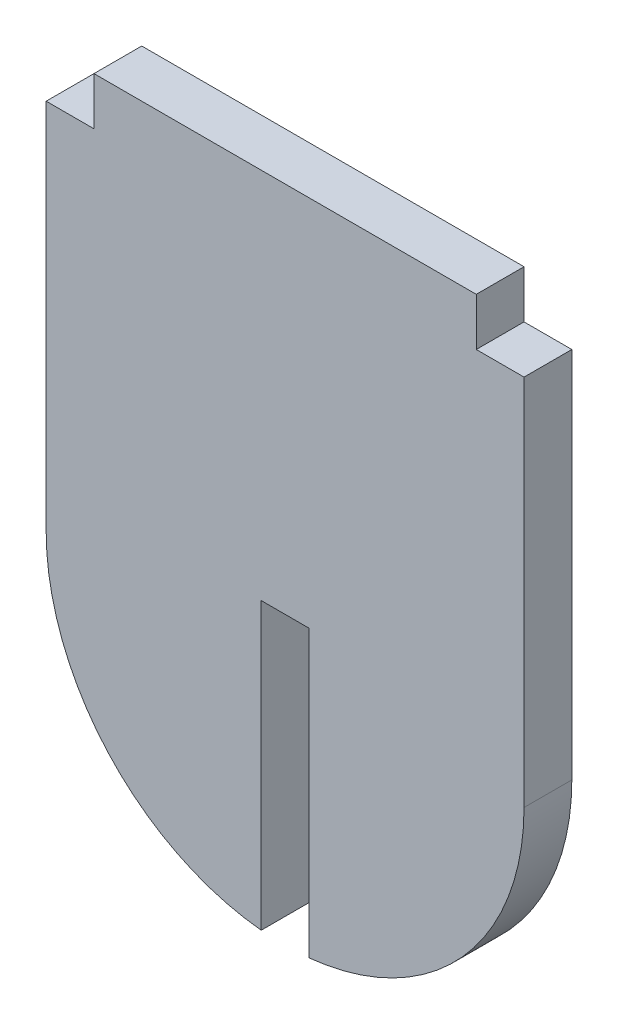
ISO-10303-21;
HEADER;
FILE_DESCRIPTION(('STEP AP214'),'2;1');
FILE_NAME('part.step','',(''),(''),'','','');
FILE_SCHEMA(('AUTOMOTIVE_DESIGN { 1 0 10303 214 1 1 1 1 }'));
ENDSEC;
DATA;
#1=APPLICATION_CONTEXT('core data for automotive mechanical design processes');
#2=APPLICATION_PROTOCOL_DEFINITION('international standard','automotive_design',2000,#1);
#3=PRODUCT_CONTEXT('',#1,'mechanical');
#4=PRODUCT('Part','Part','',(#3));
#5=PRODUCT_RELATED_PRODUCT_CATEGORY('part','',(#4));
#6=PRODUCT_DEFINITION_FORMATION('','',#4);
#7=PRODUCT_DEFINITION_CONTEXT('part definition',#1,'design');
#8=PRODUCT_DEFINITION('design','',#6,#7);
#9=PRODUCT_DEFINITION_SHAPE('','',#8);
#10=(LENGTH_UNIT() NAMED_UNIT(*) SI_UNIT(.MILLI.,.METRE.));
#11=(NAMED_UNIT(*) PLANE_ANGLE_UNIT() SI_UNIT($,.RADIAN.));
#12=(NAMED_UNIT(*) SI_UNIT($,.STERADIAN.) SOLID_ANGLE_UNIT());
#13=UNCERTAINTY_MEASURE_WITH_UNIT(LENGTH_MEASURE(1.E-05),#10,'distance_accuracy_value','');
#14=(GEOMETRIC_REPRESENTATION_CONTEXT(3) GLOBAL_UNCERTAINTY_ASSIGNED_CONTEXT((#13)) GLOBAL_UNIT_ASSIGNED_CONTEXT((#10,
#11,#12)) REPRESENTATION_CONTEXT('',''));
#15=CARTESIAN_POINT('',(0.,0.,0.));
#16=DIRECTION('',(0.,0.,1.));
#17=DIRECTION('',(1.,0.,0.));
#18=AXIS2_PLACEMENT_3D('',#15,#16,#17);
#19=CARTESIAN_POINT('',(0.,-13.97,3.175));
#20=DIRECTION('',(0.,0.,-1.));
#21=DIRECTION('',(-1.,0.,0.));
#22=AXIS2_PLACEMENT_3D('',#19,#20,#21);
#23=CYLINDRICAL_SURFACE('',#22,15.875);
#24=CARTESIAN_POINT('',(0.,-13.97,3.175));
#25=DIRECTION('',(0.,0.,1.));
#26=DIRECTION('',(1.,0.,0.));
#27=AXIS2_PLACEMENT_3D('',#24,#25,#26);
#28=CIRCLE('',#27,15.875);
#29=CARTESIAN_POINT('',(1.58749999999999,-29.7654255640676,3.175));
#30=VERTEX_POINT('',#29);
#31=CARTESIAN_POINT('',(15.875,-13.97,3.175));
#32=VERTEX_POINT('',#31);
#33=EDGE_CURVE('E161',#30,#32,#28,.T.);
#34=ORIENTED_EDGE('',*,*,#33,.F.);
#35=DIRECTION('',(0.,0.,-1.));
#36=VECTOR('',#35,1.);
#37=CARTESIAN_POINT('',(1.58749999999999,-29.7654255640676,3.175));
#38=LINE('',#37,#36);
#39=CARTESIAN_POINT('',(1.58749999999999,-29.7654255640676,0.));
#40=VERTEX_POINT('',#39);
#41=EDGE_CURVE('E171',#30,#40,#38,.T.);
#42=ORIENTED_EDGE('',*,*,#41,.T.);
#43=CARTESIAN_POINT('',(0.,-13.97,0.));
#44=DIRECTION('',(0.,0.,1.));
#45=DIRECTION('',(1.,0.,0.));
#46=AXIS2_PLACEMENT_3D('',#43,#44,#45);
#47=CIRCLE('',#46,15.875);
#48=CARTESIAN_POINT('',(15.875,-13.97,0.));
#49=VERTEX_POINT('',#48);
#50=EDGE_CURVE('E139',#40,#49,#47,.T.);
#51=ORIENTED_EDGE('',*,*,#50,.T.);
#52=DIRECTION('',(0.,0.,-1.));
#53=VECTOR('',#52,1.);
#54=CARTESIAN_POINT('',(15.875,-13.97,3.175));
#55=LINE('',#54,#53);
#56=EDGE_CURVE('E39',#32,#49,#55,.T.);
#57=ORIENTED_EDGE('',*,*,#56,.F.);
#58=EDGE_LOOP('',(#34,#42,#51,#57));
#59=FACE_BOUND('',#58,.T.);
#60=ADVANCED_FACE('F31',(#59),#23,.T.);
#61=CARTESIAN_POINT('',(-15.875,-13.97,0.));
#62=VERTEX_POINT('',#61);
#63=CARTESIAN_POINT('',(-1.58750000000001,-29.7654255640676,0.));
#64=VERTEX_POINT('',#63);
#65=EDGE_CURVE('E145',#62,#64,#47,.T.);
#66=ORIENTED_EDGE('',*,*,#65,.T.);
#67=DIRECTION('',(0.,0.,-1.));
#68=VECTOR('',#67,1.);
#69=CARTESIAN_POINT('',(-1.58750000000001,-29.7654255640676,3.175));
#70=LINE('',#69,#68);
#71=CARTESIAN_POINT('',(-1.58750000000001,-29.7654255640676,3.175));
#72=VERTEX_POINT('',#71);
#73=EDGE_CURVE('E200',#64,#72,#70,.F.);
#74=ORIENTED_EDGE('',*,*,#73,.T.);
#75=CARTESIAN_POINT('',(-15.875,-13.97,3.175));
#76=VERTEX_POINT('',#75);
#77=EDGE_CURVE('E173',#76,#72,#28,.T.);
#78=ORIENTED_EDGE('',*,*,#77,.F.);
#79=DIRECTION('',(0.,0.,-1.));
#80=VECTOR('',#79,1.);
#81=CARTESIAN_POINT('',(-15.875,-13.97,3.175));
#82=LINE('',#81,#80);
#83=EDGE_CURVE('E162',#76,#62,#82,.T.);
#84=ORIENTED_EDGE('',*,*,#83,.T.);
#85=EDGE_LOOP('',(#66,#74,#78,#84));
#86=FACE_BOUND('',#85,.T.);
#87=ADVANCED_FACE('F33',(#86),#23,.T.);
#88=CARTESIAN_POINT('',(15.875,13.97,3.175));
#89=DIRECTION('',(-1.,0.,0.));
#90=DIRECTION('',(0.,0.,1.));
#91=AXIS2_PLACEMENT_3D('',#88,#89,#90);
#92=PLANE('',#91);
#93=DIRECTION('',(0.,1.,0.));
#94=VECTOR('',#93,1.);
#95=CARTESIAN_POINT('',(15.875,13.97,0.));
#96=LINE('',#95,#94);
#97=CARTESIAN_POINT('',(15.875,10.795,0.));
#98=VERTEX_POINT('',#97);
#99=EDGE_CURVE('E141',#49,#98,#96,.T.);
#100=ORIENTED_EDGE('',*,*,#99,.T.);
#101=DIRECTION('',(0.,0.,1.));
#102=VECTOR('',#101,1.);
#103=CARTESIAN_POINT('',(15.875,10.795,0.));
#104=LINE('',#103,#102);
#105=CARTESIAN_POINT('',(15.875,10.795,3.175));
#106=VERTEX_POINT('',#105);
#107=EDGE_CURVE('E215',#98,#106,#104,.T.);
#108=ORIENTED_EDGE('',*,*,#107,.T.);
#109=DIRECTION('',(0.,1.,0.));
#110=VECTOR('',#109,1.);
#111=CARTESIAN_POINT('',(15.875,13.97,3.175));
#112=LINE('',#111,#110);
#113=EDGE_CURVE('E169',#32,#106,#112,.T.);
#114=ORIENTED_EDGE('',*,*,#113,.F.);
#115=ORIENTED_EDGE('',*,*,#56,.T.);
#116=EDGE_LOOP('',(#100,#108,#114,#115));
#117=FACE_BOUND('',#116,.T.);
#118=ADVANCED_FACE('F166',(#117),#92,.F.);
#119=CARTESIAN_POINT('',(-15.875,13.97,3.175));
#120=DIRECTION('',(0.,-1.,0.));
#121=DIRECTION('',(0.,0.,-1.));
#122=AXIS2_PLACEMENT_3D('',#119,#120,#121);
#123=PLANE('',#122);
#124=DIRECTION('',(-1.,0.,0.));
#125=VECTOR('',#124,1.);
#126=CARTESIAN_POINT('',(-15.875,13.97,3.175));
#127=LINE('',#126,#125);
#128=CARTESIAN_POINT('',(12.7,13.97,3.175));
#129=VERTEX_POINT('',#128);
#130=CARTESIAN_POINT('',(-12.7,13.97,3.175));
#131=VERTEX_POINT('',#130);
#132=EDGE_CURVE('E180',#129,#131,#127,.T.);
#133=ORIENTED_EDGE('',*,*,#132,.F.);
#134=DIRECTION('',(0.,0.,1.));
#135=VECTOR('',#134,1.);
#136=CARTESIAN_POINT('',(12.7,13.97,0.));
#137=LINE('',#136,#135);
#138=CARTESIAN_POINT('',(12.7,13.97,0.));
#139=VERTEX_POINT('',#138);
#140=EDGE_CURVE('E211',#139,#129,#137,.T.);
#141=ORIENTED_EDGE('',*,*,#140,.F.);
#142=DIRECTION('',(-1.,0.,0.));
#143=VECTOR('',#142,1.);
#144=CARTESIAN_POINT('',(-15.875,13.97,0.));
#145=LINE('',#144,#143);
#146=CARTESIAN_POINT('',(-12.7,13.97,0.));
#147=VERTEX_POINT('',#146);
#148=EDGE_CURVE('E157',#139,#147,#145,.T.);
#149=ORIENTED_EDGE('',*,*,#148,.T.);
#150=DIRECTION('',(0.,0.,1.));
#151=VECTOR('',#150,1.);
#152=CARTESIAN_POINT('',(-12.7,13.97,0.));
#153=LINE('',#152,#151);
#154=EDGE_CURVE('E146',#147,#131,#153,.T.);
#155=ORIENTED_EDGE('',*,*,#154,.T.);
#156=EDGE_LOOP('',(#133,#141,#149,#155));
#157=FACE_BOUND('',#156,.T.);
#158=ADVANCED_FACE('F254',(#157),#123,.F.);
#159=CARTESIAN_POINT('',(-15.875,13.97,3.175));
#160=DIRECTION('',(1.,0.,0.));
#161=DIRECTION('',(0.,1.,0.));
#162=AXIS2_PLACEMENT_3D('',#159,#160,#161);
#163=PLANE('',#162);
#164=DIRECTION('',(0.,-1.,0.));
#165=VECTOR('',#164,1.);
#166=CARTESIAN_POINT('',(-15.875,13.97,3.175));
#167=LINE('',#166,#165);
#168=CARTESIAN_POINT('',(-15.875,10.795,3.175));
#169=VERTEX_POINT('',#168);
#170=EDGE_CURVE('E154',#169,#76,#167,.T.);
#171=ORIENTED_EDGE('',*,*,#170,.F.);
#172=DIRECTION('',(0.,0.,1.));
#173=VECTOR('',#172,1.);
#174=CARTESIAN_POINT('',(-15.875,10.795,0.));
#175=LINE('',#174,#173);
#176=CARTESIAN_POINT('',(-15.875,10.795,0.));
#177=VERTEX_POINT('',#176);
#178=EDGE_CURVE('E178',#177,#169,#175,.T.);
#179=ORIENTED_EDGE('',*,*,#178,.F.);
#180=DIRECTION('',(0.,-1.,0.));
#181=VECTOR('',#180,1.);
#182=CARTESIAN_POINT('',(-15.875,13.97,0.));
#183=LINE('',#182,#181);
#184=EDGE_CURVE('E159',#177,#62,#183,.T.);
#185=ORIENTED_EDGE('',*,*,#184,.T.);
#186=ORIENTED_EDGE('',*,*,#83,.F.);
#187=EDGE_LOOP('',(#171,#179,#185,#186));
#188=FACE_BOUND('',#187,.T.);
#189=ADVANCED_FACE('F195',(#188),#163,.F.);
#190=CARTESIAN_POINT('',(0.,-13.97,3.175));
#191=DIRECTION('',(0.,0.,1.));
#192=DIRECTION('',(1.,0.,0.));
#193=AXIS2_PLACEMENT_3D('',#190,#191,#192);
#194=PLANE('',#193);
#195=DIRECTION('',(0.,1.,0.));
#196=VECTOR('',#195,1.);
#197=CARTESIAN_POINT('',(1.58749999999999,-10.795,3.175));
#198=LINE('',#197,#196);
#199=CARTESIAN_POINT('',(1.58749999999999,-10.795,3.175));
#200=VERTEX_POINT('',#199);
#201=EDGE_CURVE('E124',#30,#200,#198,.T.);
#202=ORIENTED_EDGE('',*,*,#201,.F.);
#203=ORIENTED_EDGE('',*,*,#33,.T.);
#204=ORIENTED_EDGE('',*,*,#113,.T.);
#205=DIRECTION('',(1.,0.,0.));
#206=VECTOR('',#205,1.);
#207=CARTESIAN_POINT('',(15.875,10.795,3.175));
#208=LINE('',#207,#206);
#209=CARTESIAN_POINT('',(12.7,10.795,3.175));
#210=VERTEX_POINT('',#209);
#211=EDGE_CURVE('E209',#210,#106,#208,.T.);
#212=ORIENTED_EDGE('',*,*,#211,.F.);
#213=DIRECTION('',(0.,-1.,0.));
#214=VECTOR('',#213,1.);
#215=CARTESIAN_POINT('',(12.7,13.97,3.175));
#216=LINE('',#215,#214);
#217=EDGE_CURVE('E202',#129,#210,#216,.T.);
#218=ORIENTED_EDGE('',*,*,#217,.F.);
#219=ORIENTED_EDGE('',*,*,#132,.T.);
#220=DIRECTION('',(0.,1.,0.));
#221=VECTOR('',#220,1.);
#222=CARTESIAN_POINT('',(-12.7,13.97,3.175));
#223=LINE('',#222,#221);
#224=CARTESIAN_POINT('',(-12.7,10.795,3.175));
#225=VERTEX_POINT('',#224);
#226=EDGE_CURVE('E224',#225,#131,#223,.T.);
#227=ORIENTED_EDGE('',*,*,#226,.F.);
#228=DIRECTION('',(1.,0.,0.));
#229=VECTOR('',#228,1.);
#230=CARTESIAN_POINT('',(-15.875,10.795,3.175));
#231=LINE('',#230,#229);
#232=EDGE_CURVE('E192',#169,#225,#231,.T.);
#233=ORIENTED_EDGE('',*,*,#232,.F.);
#234=ORIENTED_EDGE('',*,*,#170,.T.);
#235=ORIENTED_EDGE('',*,*,#77,.T.);
#236=DIRECTION('',(0.,-1.,0.));
#237=VECTOR('',#236,1.);
#238=CARTESIAN_POINT('',(-1.58750000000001,-10.795,3.175));
#239=LINE('',#238,#237);
#240=CARTESIAN_POINT('',(-1.58750000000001,-10.795,3.175));
#241=VERTEX_POINT('',#240);
#242=EDGE_CURVE('E134',#241,#72,#239,.T.);
#243=ORIENTED_EDGE('',*,*,#242,.F.);
#244=DIRECTION('',(-1.,0.,0.));
#245=VECTOR('',#244,1.);
#246=CARTESIAN_POINT('',(-1.58750000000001,-10.795,3.175));
#247=LINE('',#246,#245);
#248=EDGE_CURVE('E235',#200,#241,#247,.T.);
#249=ORIENTED_EDGE('',*,*,#248,.F.);
#250=EDGE_LOOP('',(#202,#203,#204,#212,#218,#219,#227,#233,#234,#235,#243,#249));
#251=FACE_BOUND('',#250,.T.);
#252=ADVANCED_FACE('F188',(#251),#194,.T.);
#253=CARTESIAN_POINT('',(0.,-13.97,0.));
#254=DIRECTION('',(0.,0.,1.));
#255=DIRECTION('',(1.,0.,0.));
#256=AXIS2_PLACEMENT_3D('',#253,#254,#255);
#257=PLANE('',#256);
#258=ORIENTED_EDGE('',*,*,#50,.F.);
#259=DIRECTION('',(0.,1.,0.));
#260=VECTOR('',#259,1.);
#261=CARTESIAN_POINT('',(1.58749999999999,-13.97,0.));
#262=LINE('',#261,#260);
#263=CARTESIAN_POINT('',(1.58749999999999,-10.795,0.));
#264=VERTEX_POINT('',#263);
#265=EDGE_CURVE('E11',#40,#264,#262,.T.);
#266=ORIENTED_EDGE('',*,*,#265,.T.);
#267=DIRECTION('',(-1.,0.,0.));
#268=VECTOR('',#267,1.);
#269=CARTESIAN_POINT('',(-1.58750000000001,-10.795,0.));
#270=LINE('',#269,#268);
#271=CARTESIAN_POINT('',(-1.58750000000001,-10.795,0.));
#272=VERTEX_POINT('',#271);
#273=EDGE_CURVE('E131',#264,#272,#270,.T.);
#274=ORIENTED_EDGE('',*,*,#273,.T.);
#275=DIRECTION('',(0.,-1.,0.));
#276=VECTOR('',#275,1.);
#277=CARTESIAN_POINT('',(-1.58750000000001,-10.795,0.));
#278=LINE('',#277,#276);
#279=EDGE_CURVE('E46',#272,#64,#278,.T.);
#280=ORIENTED_EDGE('',*,*,#279,.T.);
#281=ORIENTED_EDGE('',*,*,#65,.F.);
#282=ORIENTED_EDGE('',*,*,#184,.F.);
#283=DIRECTION('',(1.,0.,0.));
#284=VECTOR('',#283,1.);
#285=CARTESIAN_POINT('',(-15.875,10.795,0.));
#286=LINE('',#285,#284);
#287=CARTESIAN_POINT('',(-12.7,10.795,0.));
#288=VERTEX_POINT('',#287);
#289=EDGE_CURVE('E220',#177,#288,#286,.T.);
#290=ORIENTED_EDGE('',*,*,#289,.T.);
#291=DIRECTION('',(0.,1.,0.));
#292=VECTOR('',#291,1.);
#293=CARTESIAN_POINT('',(-12.7,13.97,0.));
#294=LINE('',#293,#292);
#295=EDGE_CURVE('E223',#288,#147,#294,.T.);
#296=ORIENTED_EDGE('',*,*,#295,.T.);
#297=ORIENTED_EDGE('',*,*,#148,.F.);
#298=DIRECTION('',(0.,-1.,0.));
#299=VECTOR('',#298,1.);
#300=CARTESIAN_POINT('',(12.7,13.97,0.));
#301=LINE('',#300,#299);
#302=CARTESIAN_POINT('',(12.7,10.795,0.));
#303=VERTEX_POINT('',#302);
#304=EDGE_CURVE('E206',#139,#303,#301,.T.);
#305=ORIENTED_EDGE('',*,*,#304,.T.);
#306=DIRECTION('',(1.,0.,0.));
#307=VECTOR('',#306,1.);
#308=CARTESIAN_POINT('',(15.875,10.795,0.));
#309=LINE('',#308,#307);
#310=EDGE_CURVE('E54',#303,#98,#309,.T.);
#311=ORIENTED_EDGE('',*,*,#310,.T.);
#312=ORIENTED_EDGE('',*,*,#99,.F.);
#313=EDGE_LOOP('',(#258,#266,#274,#280,#281,#282,#290,#296,#297,#305,#311,#312));
#314=FACE_BOUND('',#313,.T.);
#315=ADVANCED_FACE('F137',(#314),#257,.F.);
#316=CARTESIAN_POINT('',(-12.7,13.97,0.));
#317=DIRECTION('',(1.,0.,0.));
#318=DIRECTION('',(0.,0.,-1.));
#319=AXIS2_PLACEMENT_3D('',#316,#317,#318);
#320=PLANE('',#319);
#321=ORIENTED_EDGE('',*,*,#226,.T.);
#322=ORIENTED_EDGE('',*,*,#154,.F.);
#323=ORIENTED_EDGE('',*,*,#295,.F.);
#324=DIRECTION('',(0.,0.,1.));
#325=VECTOR('',#324,1.);
#326=CARTESIAN_POINT('',(-12.7,10.795,0.));
#327=LINE('',#326,#325);
#328=EDGE_CURVE('E150',#288,#225,#327,.T.);
#329=ORIENTED_EDGE('',*,*,#328,.T.);
#330=EDGE_LOOP('',(#321,#322,#323,#329));
#331=FACE_BOUND('',#330,.T.);
#332=ADVANCED_FACE('F265',(#331),#320,.F.);
#333=CARTESIAN_POINT('',(-15.875,10.795,0.));
#334=DIRECTION('',(0.,-1.,0.));
#335=DIRECTION('',(0.,0.,-1.));
#336=AXIS2_PLACEMENT_3D('',#333,#334,#335);
#337=PLANE('',#336);
#338=ORIENTED_EDGE('',*,*,#232,.T.);
#339=ORIENTED_EDGE('',*,*,#328,.F.);
#340=ORIENTED_EDGE('',*,*,#289,.F.);
#341=ORIENTED_EDGE('',*,*,#178,.T.);
#342=EDGE_LOOP('',(#338,#339,#340,#341));
#343=FACE_BOUND('',#342,.T.);
#344=ADVANCED_FACE('F231',(#343),#337,.F.);
#345=CARTESIAN_POINT('',(15.875,10.795,0.));
#346=DIRECTION('',(0.,-1.,0.));
#347=DIRECTION('',(1.,0.,0.));
#348=AXIS2_PLACEMENT_3D('',#345,#346,#347);
#349=PLANE('',#348);
#350=ORIENTED_EDGE('',*,*,#211,.T.);
#351=ORIENTED_EDGE('',*,*,#107,.F.);
#352=ORIENTED_EDGE('',*,*,#310,.F.);
#353=DIRECTION('',(0.,0.,1.));
#354=VECTOR('',#353,1.);
#355=CARTESIAN_POINT('',(12.7,10.795,0.));
#356=LINE('',#355,#354);
#357=EDGE_CURVE('E217',#303,#210,#356,.T.);
#358=ORIENTED_EDGE('',*,*,#357,.T.);
#359=EDGE_LOOP('',(#350,#351,#352,#358));
#360=FACE_BOUND('',#359,.T.);
#361=ADVANCED_FACE('F270',(#360),#349,.F.);
#362=CARTESIAN_POINT('',(12.7,13.97,0.));
#363=DIRECTION('',(-1.,0.,0.));
#364=DIRECTION('',(0.,0.,1.));
#365=AXIS2_PLACEMENT_3D('',#362,#363,#364);
#366=PLANE('',#365);
#367=ORIENTED_EDGE('',*,*,#217,.T.);
#368=ORIENTED_EDGE('',*,*,#357,.F.);
#369=ORIENTED_EDGE('',*,*,#304,.F.);
#370=ORIENTED_EDGE('',*,*,#140,.T.);
#371=EDGE_LOOP('',(#367,#368,#369,#370));
#372=FACE_BOUND('',#371,.T.);
#373=ADVANCED_FACE('F245',(#372),#366,.F.);
#374=CARTESIAN_POINT('',(1.58749999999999,-10.795,0.));
#375=DIRECTION('',(1.,0.,0.));
#376=DIRECTION('',(0.,1.,0.));
#377=AXIS2_PLACEMENT_3D('',#374,#375,#376);
#378=PLANE('',#377);
#379=ORIENTED_EDGE('',*,*,#201,.T.);
#380=DIRECTION('',(0.,0.,1.));
#381=VECTOR('',#380,1.);
#382=CARTESIAN_POINT('',(1.58749999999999,-10.795,0.));
#383=LINE('',#382,#381);
#384=EDGE_CURVE('E119',#264,#200,#383,.T.);
#385=ORIENTED_EDGE('',*,*,#384,.F.);
#386=ORIENTED_EDGE('',*,*,#265,.F.);
#387=ORIENTED_EDGE('',*,*,#41,.F.);
#388=EDGE_LOOP('',(#379,#385,#386,#387));
#389=FACE_BOUND('',#388,.T.);
#390=ADVANCED_FACE('F121',(#389),#378,.F.);
#391=CARTESIAN_POINT('',(-1.58750000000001,-10.795,0.));
#392=DIRECTION('',(-1.,0.,0.));
#393=DIRECTION('',(0.,-1.,0.));
#394=AXIS2_PLACEMENT_3D('',#391,#392,#393);
#395=PLANE('',#394);
#396=ORIENTED_EDGE('',*,*,#279,.F.);
#397=DIRECTION('',(0.,0.,1.));
#398=VECTOR('',#397,1.);
#399=CARTESIAN_POINT('',(-1.58750000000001,-10.795,0.));
#400=LINE('',#399,#398);
#401=EDGE_CURVE('E128',#272,#241,#400,.T.);
#402=ORIENTED_EDGE('',*,*,#401,.T.);
#403=ORIENTED_EDGE('',*,*,#242,.T.);
#404=ORIENTED_EDGE('',*,*,#73,.F.);
#405=EDGE_LOOP('',(#396,#402,#403,#404));
#406=FACE_BOUND('',#405,.T.);
#407=ADVANCED_FACE('F237',(#406),#395,.F.);
#408=CARTESIAN_POINT('',(-1.58750000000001,-10.795,0.));
#409=DIRECTION('',(0.,1.,0.));
#410=DIRECTION('',(0.,0.,1.));
#411=AXIS2_PLACEMENT_3D('',#408,#409,#410);
#412=PLANE('',#411);
#413=ORIENTED_EDGE('',*,*,#248,.T.);
#414=ORIENTED_EDGE('',*,*,#401,.F.);
#415=ORIENTED_EDGE('',*,*,#273,.F.);
#416=ORIENTED_EDGE('',*,*,#384,.T.);
#417=EDGE_LOOP('',(#413,#414,#415,#416));
#418=FACE_BOUND('',#417,.T.);
#419=ADVANCED_FACE('F132',(#418),#412,.F.);
#420=CLOSED_SHELL('',(#60,#87,#118,#158,#189,#252,#315,#332,#344,#361,#373,#390,#407,#419));
#421=MANIFOLD_SOLID_BREP('B2',#420);
#422=ADVANCED_BREP_SHAPE_REPRESENTATION('',(#18,#421),#14);
#423=SHAPE_DEFINITION_REPRESENTATION(#9,#422);
ENDSEC;
END-ISO-10303-21;
